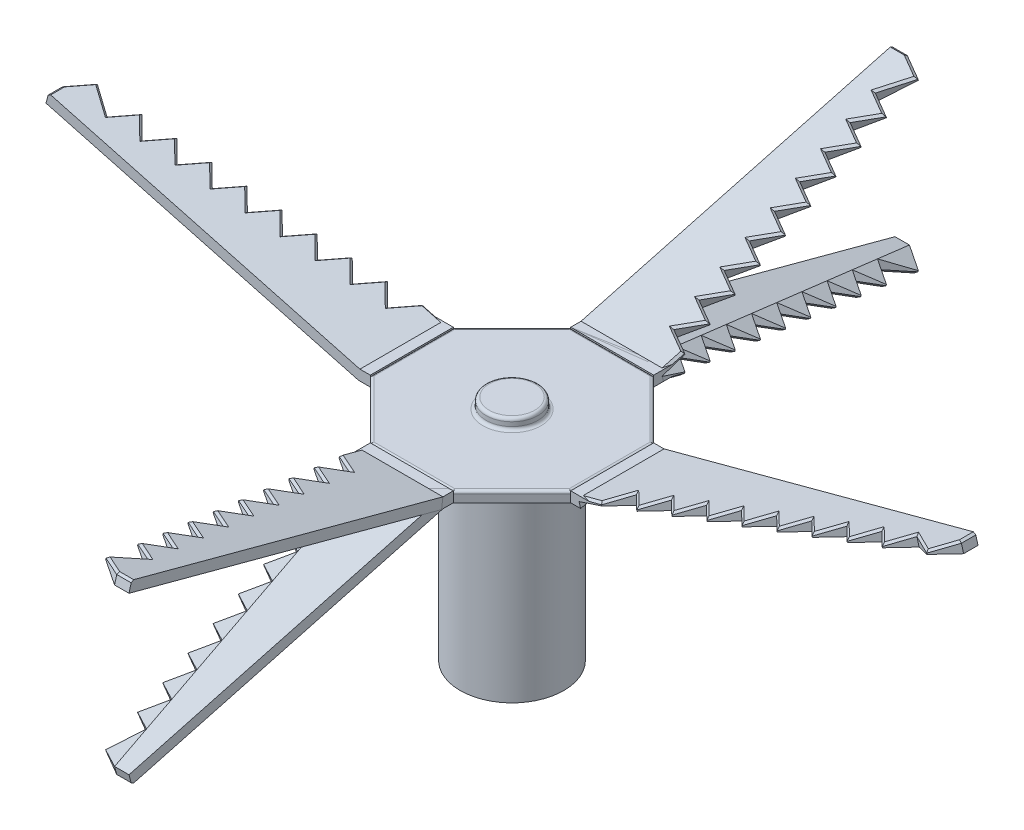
from build123d import *

# Parameters (mm, degrees)
SKETCH1_R           = 5
BOSS_EXTRUDE1_DEPTH = 20
BOSS_EXTRUDE2_DEPTH = 1
EXTRUDE_THIN2_DEPTH = 4
CUT_EXTRUDE1_DEPTH  = 8
CUT_EXTRUDE3_DEPTH  = 17.5
CHAMFER1_SIZE       = 0.2
CIRPATTERN3_COUNT   = 4
SKETCH15_R          = 2.5
BOSS_EXTRUDE3_DEPTH = 1
FILLET1_R           = 0.3
FILLET2_R           = 0.25


with BuildPart() as part:
    # Sketch1 → Boss-Extrude1 (new body)
    with BuildSketch(Plane(origin=(0, 0, 0), x_dir=(1, 0, 0), z_dir=(0, 1, 0))):
        with Locations(Location((0, 0, 0), (0, 0, 270))):
            Circle(SKETCH1_R)
    extrude(amount=BOSS_EXTRUDE1_DEPTH)

    # Sketch2 → Boss-Extrude2 (add)
    with BuildSketch(Plane(origin=(0, 20, 0), x_dir=(1, 0, 0), z_dir=(0, 1, 0))):
        Polygon((9.656854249, 4), (4, 9.656854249), (-4, 9.656854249), (-9.656854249, 4), (-9.656854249, -4), (-4, -9.656854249), (4, -9.656854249), (9.656854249, -4), align=None)
    extrude(amount=BOSS_EXTRUDE2_DEPTH)

    # Sketch15 → Boss-Extrude3 (add)
    with BuildSketch(Plane(origin=(0, 21, 0), x_dir=(1, 0, 0), z_dir=(0, 1, 0))):
        with Locations(Location((0, 0, 0), (0, 0, 270))):
            Circle(SKETCH15_R)
    extrude(amount=BOSS_EXTRUDE3_DEPTH)

    # Fillet1
    fillet1_edges = [part.edges().sort_by_distance(p)[0] for p in [
        (0, 21, -2.5),
        (0, 22, -2.5),
    ]]
    fillet(fillet1_edges, radius=FILLET1_R)

    # Fillet2
    fillet2_edges = [part.edges().sort_by_distance(p)[0] for p in [
        (-6.828427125, 21, 6.828427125),
        (0, 21, 9.656854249),
        (6.828427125, 21, 6.828427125),
        (9.656854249, 21, 0),
        (6.828427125, 21, -6.828427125),
        (0, 21, -9.656854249),
        (-6.828427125, 21, -6.828427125),
        (-9.656854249, 21, 0),
    ]]
    fillet(fillet2_edges, radius=FILLET2_R)


with BuildPart() as body_2:
    # Sketch3 → Extrude-Thin2 (new, symmetric)
    with BuildSketch(Plane.XY):
        Polygon((9.656854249, 21), (10.656854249, 21), (40.656854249, 29.038475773), (40.915673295, 28.072549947), (10.788506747, 20), (9.656854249, 20), align=None)
    extrude(amount=EXTRUDE_THIN2_DEPTH, both=True)

    # Sketch4 → Cut-Extrude1 (cut)
    with BuildSketch(Plane(origin=(-4.536126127, 16.929053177, 0), x_dir=(0.9659258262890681, 0.2588190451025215, 0), z_dir=(-0.2588190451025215, 0.9659258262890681, 0))):
        Polygon((17.728930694, -4), (18.921827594, -1.802957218), (20.735263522, -3.523843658), (21.928160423, -1.326800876), (23.74159635, -3.047687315), (24.934493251, -0.850644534), (26.747929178, -2.571530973), (27.940826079, -0.374488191), (29.754262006, -2.09537463), (30.947158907, 0.101668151), (32.760594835, -1.619218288), (33.953491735, 0.577824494), (35.766927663, -1.143061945), (36.959824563, 1.053980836), (38.773260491, -0.666905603), (39.966157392, 1.530137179), (41.779593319, -0.190749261), (42.97249022, 2.006293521), (45.594319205, 0.413443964), (46.787216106, 2.610486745), (46.787216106, -4), align=None)
    extrude(amount=-CUT_EXTRUDE1_DEPTH, mode=Mode.SUBTRACT)

    # Sketch14 → Cut-Extrude3 (cut, symmetric)
    with BuildSketch(Plane(origin=(30.628255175, 8.20681624, -5.022165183), x_dir=(-0.15110408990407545, -0.04048821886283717, -0.9876883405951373), z_dir=(0.9540336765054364, 0.2556325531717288, -0.15643446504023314))):
        Polygon((-6.724169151, 17.230758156), (-4.7407858, 16.526245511), (-6.724169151, 16.526245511), align=None)
    extrude(amount=CUT_EXTRUDE3_DEPTH, both=True, mode=Mode.SUBTRACT)

    # Chamfer1
    chamfer1_edges = [body_2.edges().sort_by_distance(p)[0] for p in [
        (11.622780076, 21.258819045, 4),
        (40.656854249, 29.038475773, -3.305243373),
        (40.080729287, 28.884103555, -1.511965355),
        (38.23835816, 28.390441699, -1.209868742),
        (36.395987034, 27.896779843, -0.90777213),
        (34.944039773, 27.507731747, -0.669693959),
        (33.492092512, 27.118683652, -0.431615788),
        (32.040145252, 26.729635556, -0.193537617),
        (30.588197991, 26.34058746, 0.044540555),
        (29.136250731, 25.951539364, 0.282618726),
        (27.68430347, 25.562491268, 0.520696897),
        (26.23235621, 25.173443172, 0.758775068),
        (24.780408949, 24.784395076, 0.996853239),
        (23.328461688, 24.39534698, 1.234931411),
        (21.876514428, 24.006298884, 1.473009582),
        (20.424567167, 23.617250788, 1.711087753),
        (18.972619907, 23.228202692, 1.949165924),
        (17.520672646, 22.839154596, 2.187244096),
        (16.068725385, 22.4501065, 2.425322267),
        (14.616778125, 22.061058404, 2.663400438),
        (13.164830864, 21.672010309, 2.901478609),
    ]]
    chamfer(chamfer1_edges, length=CHAMFER1_SIZE)


with BuildPart() as cirpattern3_1:
    # CirPattern3: pattern copy
    add(body_2.part.rotate(Axis((0, 0, 0), (0, 1, 0)), 1 * 360 / CIRPATTERN3_COUNT))


with BuildPart() as cirpattern3_2:
    # CirPattern3: pattern copy
    add(body_2.part.rotate(Axis((0, 0, 0), (0, 1, 0)), 2 * 360 / CIRPATTERN3_COUNT))


with BuildPart() as cirpattern3_3:
    # CirPattern3: pattern copy
    add(body_2.part.rotate(Axis((0, 0, 0), (0, 1, 0)), 3 * 360 / CIRPATTERN3_COUNT))


with BuildPart() as body_6:
    # Mirror3: mirrored copy
    add(cirpattern3_1.part.mirror(Plane.ZX.offset(20.5)))


with BuildPart() as body_7:
    # Mirror3 2: mirrored copy
    add(cirpattern3_3.part.mirror(Plane.ZX.offset(20.5)))


solid = Compound([part.part, body_2.part, cirpattern3_1.part, cirpattern3_2.part, cirpattern3_3.part, body_6.part, body_7.part])
